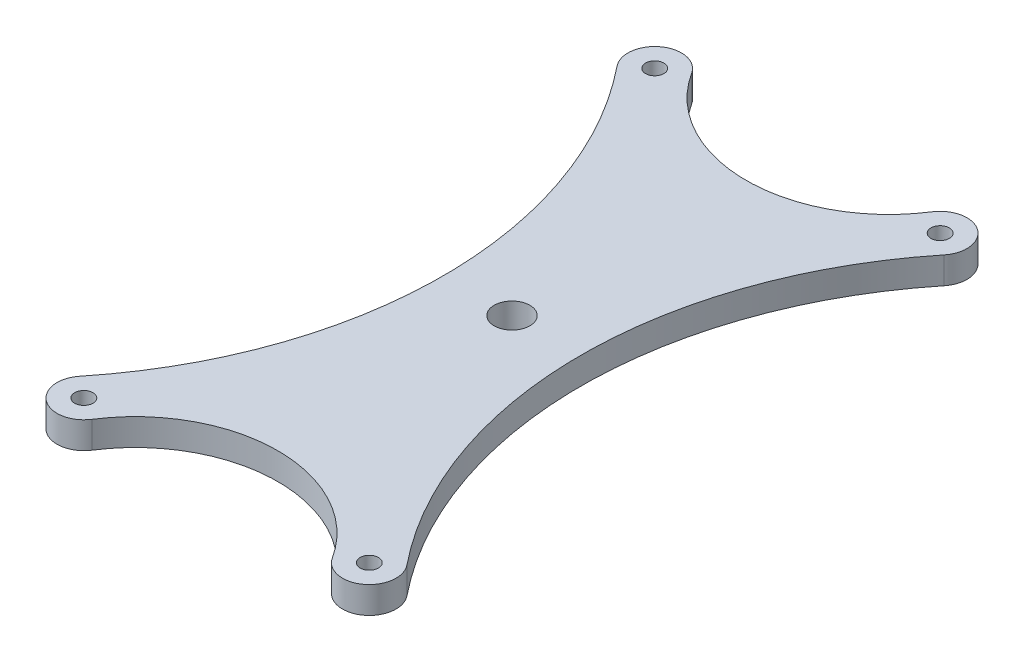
from build123d import *

# Parameters (mm, degrees)
SKETCH1_R           = 3.2639
SKETCH1_R_2         = 6.35
BOSS_EXTRUDE1_DEPTH = 9.525


with BuildPart() as part:
    # Sketch1 → Boss-Extrude1 (new body)
    with BuildSketch(Plane(origin=(0, 0, 0), x_dir=(1, 0, 0), z_dir=(0, 1, 0))):
        with BuildLine():
            ThreePointArc((-42.778947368, 106.736958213), (-56.364924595, 109.330280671), (-58.216699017, 95.623529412))
            ThreePointArc((-58.216699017, 95.623529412), (-24.483883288, 0), (-58.216699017, -95.623529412))
            ThreePointArc((-58.216699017, -95.623529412), (-56.364924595, -109.330280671), (-42.778947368, -106.736958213))
            ThreePointArc((-42.778947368, -106.736958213), (0, -83.334068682), (42.778947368, -106.736958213))
            ThreePointArc((42.778947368, -106.736958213), (56.364924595, -109.330280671), (58.216699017, -95.623529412))
            ThreePointArc((58.216699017, -95.623529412), (24.483883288, 0), (58.216699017, 95.623529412))
            ThreePointArc((58.216699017, 95.623529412), (56.364924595, 109.330280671), (42.778947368, 106.736958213))
            ThreePointArc((42.778947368, 106.736958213), (0, 83.334068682), (-42.778947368, 106.736958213))
        make_face()
        with Locations(Location((-50.8, 101.6, 0), (0, 0, 90))):
            Circle(SKETCH1_R, mode=Mode.SUBTRACT)
        with Locations(Location((50.8, 101.6, 0), (0, 0, 90))):
            Circle(SKETCH1_R, mode=Mode.SUBTRACT)
        with Locations(Location((-50.8, -101.6, 0), (0, 0, 90))):
            Circle(SKETCH1_R, mode=Mode.SUBTRACT)
        with Locations(Location((50.8, -101.6, 0), (0, 0, 90))):
            Circle(SKETCH1_R, mode=Mode.SUBTRACT)
        with Locations(Location((0, 0, 0), (0, 0, 90))):
            Circle(SKETCH1_R_2, mode=Mode.SUBTRACT)
    extrude(amount=BOSS_EXTRUDE1_DEPTH)


solid = part.part
